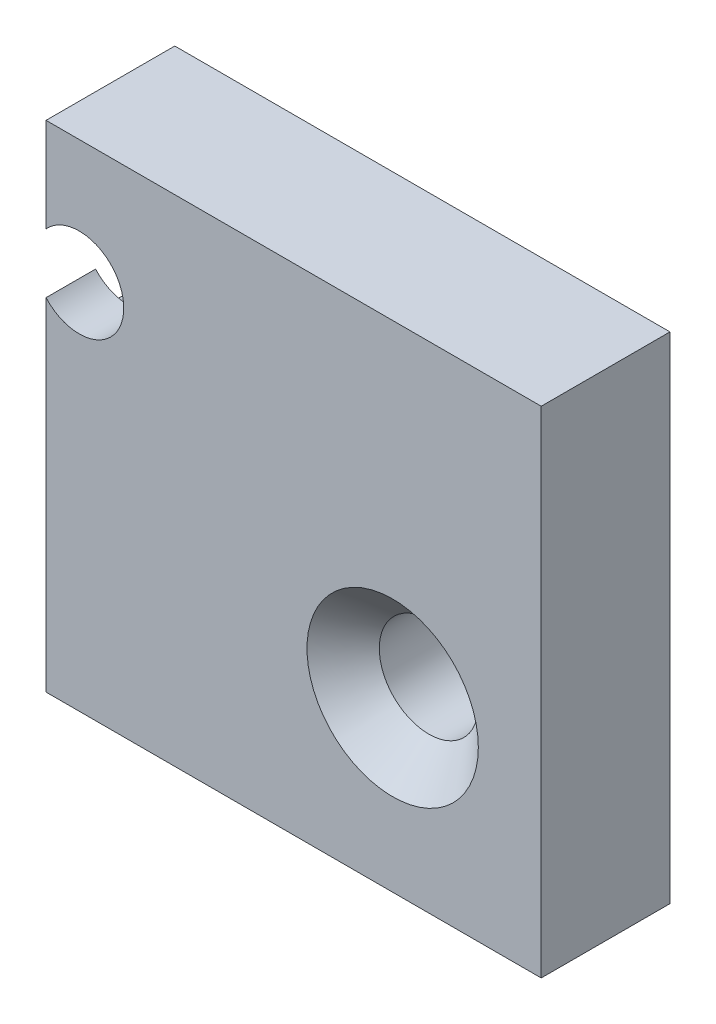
ISO-10303-21;
HEADER;
FILE_DESCRIPTION(('STEP AP214'),'2;1');
FILE_NAME('part.step','',(''),(''),'','','');
FILE_SCHEMA(('AUTOMOTIVE_DESIGN { 1 0 10303 214 1 1 1 1 }'));
ENDSEC;
DATA;
#1=APPLICATION_CONTEXT('core data for automotive mechanical design processes');
#2=APPLICATION_PROTOCOL_DEFINITION('international standard','automotive_design',2000,#1);
#3=PRODUCT_CONTEXT('',#1,'mechanical');
#4=PRODUCT('Part','Part','',(#3));
#5=PRODUCT_RELATED_PRODUCT_CATEGORY('part','',(#4));
#6=PRODUCT_DEFINITION_FORMATION('','',#4);
#7=PRODUCT_DEFINITION_CONTEXT('part definition',#1,'design');
#8=PRODUCT_DEFINITION('design','',#6,#7);
#9=PRODUCT_DEFINITION_SHAPE('','',#8);
#10=(LENGTH_UNIT() NAMED_UNIT(*) SI_UNIT(.MILLI.,.METRE.));
#11=(NAMED_UNIT(*) PLANE_ANGLE_UNIT() SI_UNIT($,.RADIAN.));
#12=(NAMED_UNIT(*) SI_UNIT($,.STERADIAN.) SOLID_ANGLE_UNIT());
#13=UNCERTAINTY_MEASURE_WITH_UNIT(LENGTH_MEASURE(1.E-05),#10,'distance_accuracy_value','');
#14=(GEOMETRIC_REPRESENTATION_CONTEXT(3) GLOBAL_UNCERTAINTY_ASSIGNED_CONTEXT((#13)) GLOBAL_UNIT_ASSIGNED_CONTEXT((#10,
#11,#12)) REPRESENTATION_CONTEXT('',''));
#15=CARTESIAN_POINT('',(0.,0.,0.));
#16=DIRECTION('',(0.,0.,1.));
#17=DIRECTION('',(1.,0.,0.));
#18=AXIS2_PLACEMENT_3D('',#15,#16,#17);
#19=CARTESIAN_POINT('',(-25.,25.,13.));
#20=DIRECTION('',(1.,0.,0.));
#21=DIRECTION('',(0.,1.,0.));
#22=AXIS2_PLACEMENT_3D('',#19,#20,#21);
#23=PLANE('',#22);
#24=DIRECTION('',(0.,-1.,0.));
#25=VECTOR('',#24,1.);
#26=CARTESIAN_POINT('',(-25.,25.,8.));
#27=LINE('',#26,#25);
#28=CARTESIAN_POINT('',(-25.,9.49471220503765,8.));
#29=VERTEX_POINT('',#28);
#30=CARTESIAN_POINT('',(-25.,5.78942962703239,8.));
#31=VERTEX_POINT('',#30);
#32=EDGE_CURVE('E11',#29,#31,#27,.T.);
#33=ORIENTED_EDGE('',*,*,#32,.T.);
#34=DIRECTION('',(0.,0.,-1.));
#35=VECTOR('',#34,1.);
#36=CARTESIAN_POINT('',(-25.,5.78942962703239,0.));
#37=LINE('',#36,#35);
#38=CARTESIAN_POINT('',(-25.,5.78942962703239,0.));
#39=VERTEX_POINT('',#38);
#40=EDGE_CURVE('E438',#31,#39,#37,.T.);
#41=ORIENTED_EDGE('',*,*,#40,.T.);
#42=DIRECTION('',(0.,-1.,0.));
#43=VECTOR('',#42,1.);
#44=CARTESIAN_POINT('',(-25.,25.,0.));
#45=LINE('',#44,#43);
#46=CARTESIAN_POINT('',(-25.,-25.,0.));
#47=VERTEX_POINT('',#46);
#48=EDGE_CURVE('E463',#39,#47,#45,.T.);
#49=ORIENTED_EDGE('',*,*,#48,.T.);
#50=DIRECTION('',(0.,0.,-1.));
#51=VECTOR('',#50,1.);
#52=CARTESIAN_POINT('',(-25.,-25.,13.));
#53=LINE('',#52,#51);
#54=CARTESIAN_POINT('',(-25.,-25.,13.));
#55=VERTEX_POINT('',#54);
#56=EDGE_CURVE('E435',#55,#47,#53,.T.);
#57=ORIENTED_EDGE('',*,*,#56,.F.);
#58=DIRECTION('',(0.,-1.,0.));
#59=VECTOR('',#58,1.);
#60=CARTESIAN_POINT('',(-25.,25.,13.));
#61=LINE('',#60,#59);
#62=CARTESIAN_POINT('',(-25.,9.49471220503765,13.));
#63=VERTEX_POINT('',#62);
#64=EDGE_CURVE('E471',#63,#55,#61,.T.);
#65=ORIENTED_EDGE('',*,*,#64,.F.);
#66=DIRECTION('',(0.,0.,-1.));
#67=VECTOR('',#66,1.);
#68=CARTESIAN_POINT('',(-25.,9.49471220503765,0.));
#69=LINE('',#68,#67);
#70=EDGE_CURVE('E451',#63,#29,#69,.T.);
#71=ORIENTED_EDGE('',*,*,#70,.T.);
#72=EDGE_LOOP('',(#33,#41,#49,#57,#65,#71));
#73=FACE_BOUND('',#72,.T.);
#74=ADVANCED_FACE('F361',(#73),#23,.F.);
#75=CARTESIAN_POINT('',(-25.,25.,13.));
#76=DIRECTION('',(0.,0.,1.));
#77=DIRECTION('',(1.,0.,0.));
#78=AXIS2_PLACEMENT_3D('',#75,#76,#77);
#79=PLANE('',#78);
#80=CARTESIAN_POINT('',(10.,-8.,13.));
#81=DIRECTION('',(0.,0.,1.));
#82=DIRECTION('',(1.,0.,0.));
#83=AXIS2_PLACEMENT_3D('',#80,#81,#82);
#84=CIRCLE('',#83,8.65);
#85=CARTESIAN_POINT('',(18.65,-8.,13.));
#86=VERTEX_POINT('',#85);
#87=EDGE_CURVE('E454',#86,#86,#84,.T.);
#88=ORIENTED_EDGE('',*,*,#87,.F.);
#89=EDGE_LOOP('',(#88));
#90=FACE_BOUND('',#89,.T.);
#91=CARTESIAN_POINT('',(-25.,25.,13.));
#92=VERTEX_POINT('',#91);
#93=CARTESIAN_POINT('',(-25.,15.5052877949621,13.));
#94=VERTEX_POINT('',#93);
#95=EDGE_CURVE('E472',#92,#94,#61,.T.);
#96=ORIENTED_EDGE('',*,*,#95,.T.);
#97=CARTESIAN_POINT('',(-21.6506350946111,12.4999999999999,13.));
#98=DIRECTION('',(0.,0.,-1.));
#99=DIRECTION('',(-1.,0.,0.));
#100=AXIS2_PLACEMENT_3D('',#97,#98,#99);
#101=CIRCLE('',#100,4.5);
#102=EDGE_CURVE('E509',#94,#63,#101,.T.);
#103=ORIENTED_EDGE('',*,*,#102,.T.);
#104=ORIENTED_EDGE('',*,*,#64,.T.);
#105=DIRECTION('',(1.,0.,0.));
#106=VECTOR('',#105,1.);
#107=CARTESIAN_POINT('',(-25.,-25.,13.));
#108=LINE('',#107,#106);
#109=CARTESIAN_POINT('',(25.,-25.,13.));
#110=VERTEX_POINT('',#109);
#111=EDGE_CURVE('E474',#55,#110,#108,.T.);
#112=ORIENTED_EDGE('',*,*,#111,.T.);
#113=DIRECTION('',(0.,1.,0.));
#114=VECTOR('',#113,1.);
#115=CARTESIAN_POINT('',(25.,25.,13.));
#116=LINE('',#115,#114);
#117=CARTESIAN_POINT('',(25.,25.,13.));
#118=VERTEX_POINT('',#117);
#119=EDGE_CURVE('E476',#110,#118,#116,.T.);
#120=ORIENTED_EDGE('',*,*,#119,.T.);
#121=DIRECTION('',(-1.,0.,0.));
#122=VECTOR('',#121,1.);
#123=CARTESIAN_POINT('',(-25.,25.,13.));
#124=LINE('',#123,#122);
#125=EDGE_CURVE('E384',#118,#92,#124,.T.);
#126=ORIENTED_EDGE('',*,*,#125,.T.);
#127=EDGE_LOOP('',(#96,#103,#104,#112,#120,#126));
#128=FACE_BOUND('',#127,.T.);
#129=ADVANCED_FACE('F508',(#90,#128),#79,.T.);
#130=CARTESIAN_POINT('',(-25.,25.,0.));
#131=VERTEX_POINT('',#130);
#132=CARTESIAN_POINT('',(-25.,19.2105703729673,0.));
#133=VERTEX_POINT('',#132);
#134=EDGE_CURVE('E444',#131,#133,#45,.T.);
#135=ORIENTED_EDGE('',*,*,#134,.T.);
#136=DIRECTION('',(0.,0.,-1.));
#137=VECTOR('',#136,1.);
#138=CARTESIAN_POINT('',(-25.,19.2105703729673,0.));
#139=LINE('',#138,#137);
#140=CARTESIAN_POINT('',(-25.,19.2105703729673,8.));
#141=VERTEX_POINT('',#140);
#142=EDGE_CURVE('E376',#133,#141,#139,.F.);
#143=ORIENTED_EDGE('',*,*,#142,.T.);
#144=CARTESIAN_POINT('',(-25.,15.5052877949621,8.));
#145=VERTEX_POINT('',#144);
#146=EDGE_CURVE('E365',#141,#145,#27,.T.);
#147=ORIENTED_EDGE('',*,*,#146,.T.);
#148=DIRECTION('',(0.,0.,-1.));
#149=VECTOR('',#148,1.);
#150=CARTESIAN_POINT('',(-25.,15.5052877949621,0.));
#151=LINE('',#150,#149);
#152=EDGE_CURVE('E446',#145,#94,#151,.F.);
#153=ORIENTED_EDGE('',*,*,#152,.T.);
#154=ORIENTED_EDGE('',*,*,#95,.F.);
#155=DIRECTION('',(0.,0.,-1.));
#156=VECTOR('',#155,1.);
#157=CARTESIAN_POINT('',(-25.,25.,13.));
#158=LINE('',#157,#156);
#159=EDGE_CURVE('E479',#92,#131,#158,.T.);
#160=ORIENTED_EDGE('',*,*,#159,.T.);
#161=EDGE_LOOP('',(#135,#143,#147,#153,#154,#160));
#162=FACE_BOUND('',#161,.T.);
#163=ADVANCED_FACE('F363',(#162),#23,.F.);
#164=CARTESIAN_POINT('',(-25.,-25.,13.));
#165=DIRECTION('',(0.,1.,0.));
#166=DIRECTION('',(0.,0.,1.));
#167=AXIS2_PLACEMENT_3D('',#164,#165,#166);
#168=PLANE('',#167);
#169=DIRECTION('',(1.,0.,0.));
#170=VECTOR('',#169,1.);
#171=CARTESIAN_POINT('',(-25.,-25.,0.));
#172=LINE('',#171,#170);
#173=CARTESIAN_POINT('',(25.,-25.,0.));
#174=VERTEX_POINT('',#173);
#175=EDGE_CURVE('E465',#47,#174,#172,.T.);
#176=ORIENTED_EDGE('',*,*,#175,.T.);
#177=DIRECTION('',(0.,0.,-1.));
#178=VECTOR('',#177,1.);
#179=CARTESIAN_POINT('',(25.,-25.,13.));
#180=LINE('',#179,#178);
#181=EDGE_CURVE('E484',#110,#174,#180,.T.);
#182=ORIENTED_EDGE('',*,*,#181,.F.);
#183=ORIENTED_EDGE('',*,*,#111,.F.);
#184=ORIENTED_EDGE('',*,*,#56,.T.);
#185=EDGE_LOOP('',(#176,#182,#183,#184));
#186=FACE_BOUND('',#185,.T.);
#187=ADVANCED_FACE('F490',(#186),#168,.F.);
#188=CARTESIAN_POINT('',(25.,25.,13.));
#189=DIRECTION('',(-1.,0.,0.));
#190=DIRECTION('',(0.,-1.,0.));
#191=AXIS2_PLACEMENT_3D('',#188,#189,#190);
#192=PLANE('',#191);
#193=DIRECTION('',(0.,1.,0.));
#194=VECTOR('',#193,1.);
#195=CARTESIAN_POINT('',(25.,25.,0.));
#196=LINE('',#195,#194);
#197=CARTESIAN_POINT('',(25.,25.,0.));
#198=VERTEX_POINT('',#197);
#199=EDGE_CURVE('E467',#174,#198,#196,.T.);
#200=ORIENTED_EDGE('',*,*,#199,.T.);
#201=DIRECTION('',(0.,0.,-1.));
#202=VECTOR('',#201,1.);
#203=CARTESIAN_POINT('',(25.,25.,13.));
#204=LINE('',#203,#202);
#205=EDGE_CURVE('E481',#118,#198,#204,.T.);
#206=ORIENTED_EDGE('',*,*,#205,.F.);
#207=ORIENTED_EDGE('',*,*,#119,.F.);
#208=ORIENTED_EDGE('',*,*,#181,.T.);
#209=EDGE_LOOP('',(#200,#206,#207,#208));
#210=FACE_BOUND('',#209,.T.);
#211=ADVANCED_FACE('F502',(#210),#192,.F.);
#212=CARTESIAN_POINT('',(-25.,25.,13.));
#213=DIRECTION('',(0.,-1.,0.));
#214=DIRECTION('',(1.,0.,0.));
#215=AXIS2_PLACEMENT_3D('',#212,#213,#214);
#216=PLANE('',#215);
#217=DIRECTION('',(-1.,0.,0.));
#218=VECTOR('',#217,1.);
#219=CARTESIAN_POINT('',(-25.,25.,0.));
#220=LINE('',#219,#218);
#221=EDGE_CURVE('E469',#198,#131,#220,.T.);
#222=ORIENTED_EDGE('',*,*,#221,.T.);
#223=ORIENTED_EDGE('',*,*,#159,.F.);
#224=ORIENTED_EDGE('',*,*,#125,.F.);
#225=ORIENTED_EDGE('',*,*,#205,.T.);
#226=EDGE_LOOP('',(#222,#223,#224,#225));
#227=FACE_BOUND('',#226,.T.);
#228=ADVANCED_FACE('F505',(#227),#216,.F.);
#229=CARTESIAN_POINT('',(-25.,25.,0.));
#230=DIRECTION('',(0.,0.,1.));
#231=DIRECTION('',(1.,0.,0.));
#232=AXIS2_PLACEMENT_3D('',#229,#230,#231);
#233=PLANE('',#232);
#234=CARTESIAN_POINT('',(10.,-8.,0.));
#235=DIRECTION('',(0.,0.,1.));
#236=DIRECTION('',(1.,0.,0.));
#237=AXIS2_PLACEMENT_3D('',#234,#235,#236);
#238=CIRCLE('',#237,4.99999999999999);
#239=CARTESIAN_POINT('',(15.,-8.,0.));
#240=VERTEX_POINT('',#239);
#241=EDGE_CURVE('E460',#240,#240,#238,.T.);
#242=ORIENTED_EDGE('',*,*,#241,.T.);
#243=EDGE_LOOP('',(#242));
#244=FACE_BOUND('',#243,.T.);
#245=ORIENTED_EDGE('',*,*,#48,.F.);
#246=CARTESIAN_POINT('',(-21.6506350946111,12.4999999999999,0.));
#247=DIRECTION('',(0.,0.,-1.));
#248=DIRECTION('',(-1.,0.,0.));
#249=AXIS2_PLACEMENT_3D('',#246,#247,#248);
#250=CIRCLE('',#249,7.5);
#251=EDGE_CURVE('E439',#133,#39,#250,.T.);
#252=ORIENTED_EDGE('',*,*,#251,.F.);
#253=ORIENTED_EDGE('',*,*,#134,.F.);
#254=ORIENTED_EDGE('',*,*,#221,.F.);
#255=ORIENTED_EDGE('',*,*,#199,.F.);
#256=ORIENTED_EDGE('',*,*,#175,.F.);
#257=EDGE_LOOP('',(#245,#252,#253,#254,#255,#256));
#258=FACE_BOUND('',#257,.T.);
#259=ADVANCED_FACE('F498',(#244,#258),#233,.F.);
#260=CARTESIAN_POINT('',(10.,-8.,13.));
#261=DIRECTION('',(0.,0.,1.));
#262=DIRECTION('',(1.,0.,0.));
#263=AXIS2_PLACEMENT_3D('',#260,#261,#262);
#264=CYLINDRICAL_SURFACE('',#263,4.99999999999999);
#265=ORIENTED_EDGE('',*,*,#241,.F.);
#266=EDGE_LOOP('',(#265));
#267=FACE_BOUND('',#266,.T.);
#268=CARTESIAN_POINT('',(10.,-8.,9.35));
#269=DIRECTION('',(0.,0.,1.));
#270=DIRECTION('',(1.,0.,0.));
#271=AXIS2_PLACEMENT_3D('',#268,#269,#270);
#272=CIRCLE('',#271,4.99999999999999);
#273=CARTESIAN_POINT('',(15.,-8.,9.35));
#274=VERTEX_POINT('',#273);
#275=EDGE_CURVE('E457',#274,#274,#272,.T.);
#276=ORIENTED_EDGE('',*,*,#275,.T.);
#277=EDGE_LOOP('',(#276));
#278=FACE_BOUND('',#277,.T.);
#279=ADVANCED_FACE('F543',(#267,#278),#264,.F.);
#280=CARTESIAN_POINT('',(10.,-8.,13.));
#281=DIRECTION('',(0.,0.,1.));
#282=DIRECTION('',(1.,0.,0.));
#283=AXIS2_PLACEMENT_3D('',#280,#281,#282);
#284=CONICAL_SURFACE('',#283,8.65,0.78539816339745);
#285=ORIENTED_EDGE('',*,*,#275,.F.);
#286=EDGE_LOOP('',(#285));
#287=FACE_BOUND('',#286,.T.);
#288=ORIENTED_EDGE('',*,*,#87,.T.);
#289=EDGE_LOOP('',(#288));
#290=FACE_BOUND('',#289,.T.);
#291=ADVANCED_FACE('F521',(#287,#290),#284,.F.);
#292=CARTESIAN_POINT('',(-17.1506350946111,12.4999999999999,8.));
#293=DIRECTION('',(0.,0.,1.));
#294=DIRECTION('',(1.,0.,0.));
#295=AXIS2_PLACEMENT_3D('',#292,#293,#294);
#296=PLANE('',#295);
#297=CARTESIAN_POINT('',(-21.6506350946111,12.4999999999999,8.));
#298=DIRECTION('',(0.,0.,-1.));
#299=DIRECTION('',(-1.,0.,0.));
#300=AXIS2_PLACEMENT_3D('',#297,#298,#299);
#301=CIRCLE('',#300,7.5);
#302=EDGE_CURVE('E430',#141,#31,#301,.T.);
#303=ORIENTED_EDGE('',*,*,#302,.T.);
#304=ORIENTED_EDGE('',*,*,#32,.F.);
#305=CARTESIAN_POINT('',(-21.6506350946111,12.4999999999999,8.));
#306=DIRECTION('',(0.,0.,-1.));
#307=DIRECTION('',(-1.,0.,0.));
#308=AXIS2_PLACEMENT_3D('',#305,#306,#307);
#309=CIRCLE('',#308,4.5);
#310=EDGE_CURVE('E432',#145,#29,#309,.T.);
#311=ORIENTED_EDGE('',*,*,#310,.F.);
#312=ORIENTED_EDGE('',*,*,#146,.F.);
#313=EDGE_LOOP('',(#303,#304,#311,#312));
#314=FACE_BOUND('',#313,.T.);
#315=ADVANCED_FACE('F429',(#314),#296,.F.);
#316=CARTESIAN_POINT('',(-21.6506350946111,12.4999999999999,0.));
#317=DIRECTION('',(0.,0.,-1.));
#318=DIRECTION('',(-1.,0.,0.));
#319=AXIS2_PLACEMENT_3D('',#316,#317,#318);
#320=CYLINDRICAL_SURFACE('',#319,4.5);
#321=ORIENTED_EDGE('',*,*,#102,.F.);
#322=ORIENTED_EDGE('',*,*,#152,.F.);
#323=ORIENTED_EDGE('',*,*,#310,.T.);
#324=ORIENTED_EDGE('',*,*,#70,.F.);
#325=EDGE_LOOP('',(#321,#322,#323,#324));
#326=FACE_BOUND('',#325,.T.);
#327=ADVANCED_FACE('F513',(#326),#320,.F.);
#328=CARTESIAN_POINT('',(-21.6506350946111,12.4999999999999,0.));
#329=DIRECTION('',(0.,0.,-1.));
#330=DIRECTION('',(-1.,0.,0.));
#331=AXIS2_PLACEMENT_3D('',#328,#329,#330);
#332=CYLINDRICAL_SURFACE('',#331,7.5);
#333=ORIENTED_EDGE('',*,*,#302,.F.);
#334=ORIENTED_EDGE('',*,*,#142,.F.);
#335=ORIENTED_EDGE('',*,*,#251,.T.);
#336=ORIENTED_EDGE('',*,*,#40,.F.);
#337=EDGE_LOOP('',(#333,#334,#335,#336));
#338=FACE_BOUND('',#337,.T.);
#339=ADVANCED_FACE('F436',(#338),#332,.F.);
#340=CLOSED_SHELL('',(#74,#129,#163,#187,#211,#228,#259,#279,#291,#315,#327,#339));
#341=MANIFOLD_SOLID_BREP('B2',#340);
#342=ADVANCED_BREP_SHAPE_REPRESENTATION('',(#18,#341),#14);
#343=SHAPE_DEFINITION_REPRESENTATION(#9,#342);
ENDSEC;
END-ISO-10303-21;
